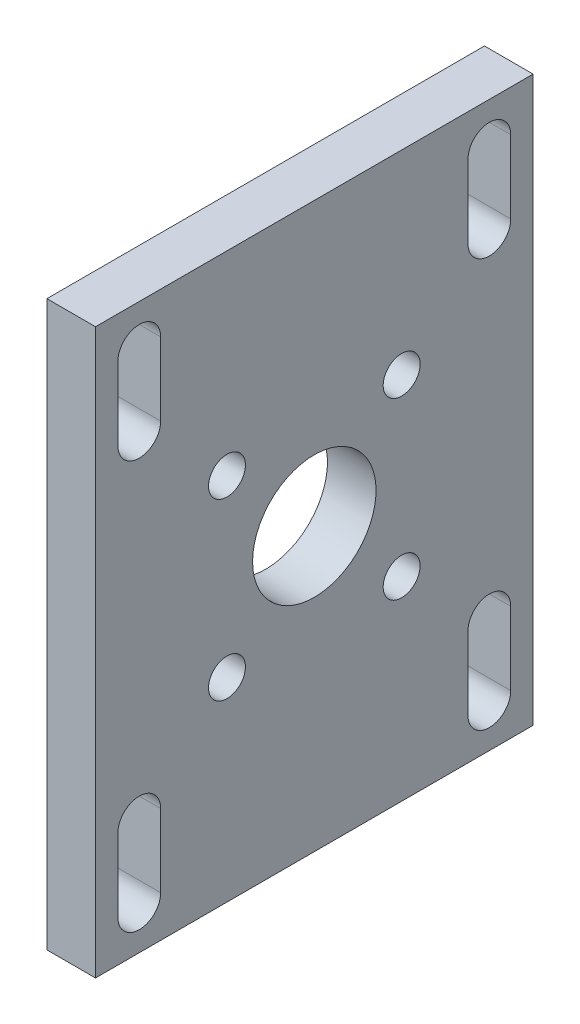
from build123d import *

# Parameters (mm, degrees)
SKETCH1_W                                      = 45
SKETCH1_H                                      = 58
BOSS_EXTRUDE1_DEPTH                            = 5
SKETCH2_R                                      = 6.35
CUT_EXTRUDE1_DEPTH                             = 38.043892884
CSK_FOR_6_FLAT_HEAD_MACHINE_SCREW1_D           = 3.7973
CSK_FOR_6_FLAT_HEAD_MACHINE_SCREW1_CSINK_D     = 7.0866
CSK_FOR_6_FLAT_HEAD_MACHINE_SCREW1_CSINK_ANGLE = 82
CUT_EXTRUDE2_DEPTH                             = 38.043892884
LPATTERN1_COUNT                                = 2
LPATTERN1_PITCH                                = 36
LPATTERN1_COUNT_DIR2                           = 2
LPATTERN1_PITCH_DIR2                           = 42


with BuildPart() as part:
    # Sketch1 → Boss-Extrude1 (new body)
    with BuildSketch(Plane(origin=(0, 0, 0), x_dir=(0, 0, -1), z_dir=(1, 0, 0))):
        Rectangle(SKETCH1_W, SKETCH1_H)
    extrude(amount=BOSS_EXTRUDE1_DEPTH)

    # Sketch2 → Cut-Extrude1 (cut, through all)
    with BuildSketch(Plane.ZY):
        Circle(SKETCH2_R)
    extrude(amount=-CUT_EXTRUDE1_DEPTH, mode=Mode.SUBTRACT)

    # CSK for _6 Flat Head Machine Screw1 (through all)
    with Locations(Plane.ZY):
        with Locations((-8.980256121, 8.980256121), (8.980256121, 8.980256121), (8.980256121, -8.980256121), (-8.980256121, -8.980256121)):
            CounterSinkHole(CSK_FOR_6_FLAT_HEAD_MACHINE_SCREW1_D / 2, CSK_FOR_6_FLAT_HEAD_MACHINE_SCREW1_CSINK_D / 2, counter_sink_angle=CSK_FOR_6_FLAT_HEAD_MACHINE_SCREW1_CSINK_ANGLE)

    # Sketch8 → Cut-Extrude2 (cut, through all)
    with BuildSketch(Plane.ZY):
        with BuildLine():
            Line((-20.2, -24.75), (-20.2, -17.25))
            ThreePointArc((-20.2, -17.25), (-18, -15.05), (-15.8, -17.25))
            Line((-15.8, -17.25), (-15.8, -24.75))
            ThreePointArc((-15.8, -24.75), (-18, -26.95), (-20.2, -24.75))
        make_face()
    cut_extrude2 = extrude(amount=-CUT_EXTRUDE2_DEPTH, mode=Mode.SUBTRACT)

    # LPattern1: Cut-Extrude2 2 × 2
    with Locations(*[(0, j * LPATTERN1_PITCH_DIR2, i * LPATTERN1_PITCH) for i in range(LPATTERN1_COUNT) for j in range(LPATTERN1_COUNT_DIR2) if (i, j) != (0, 0)]):
        add(cut_extrude2, mode=Mode.SUBTRACT)


solid = part.part
